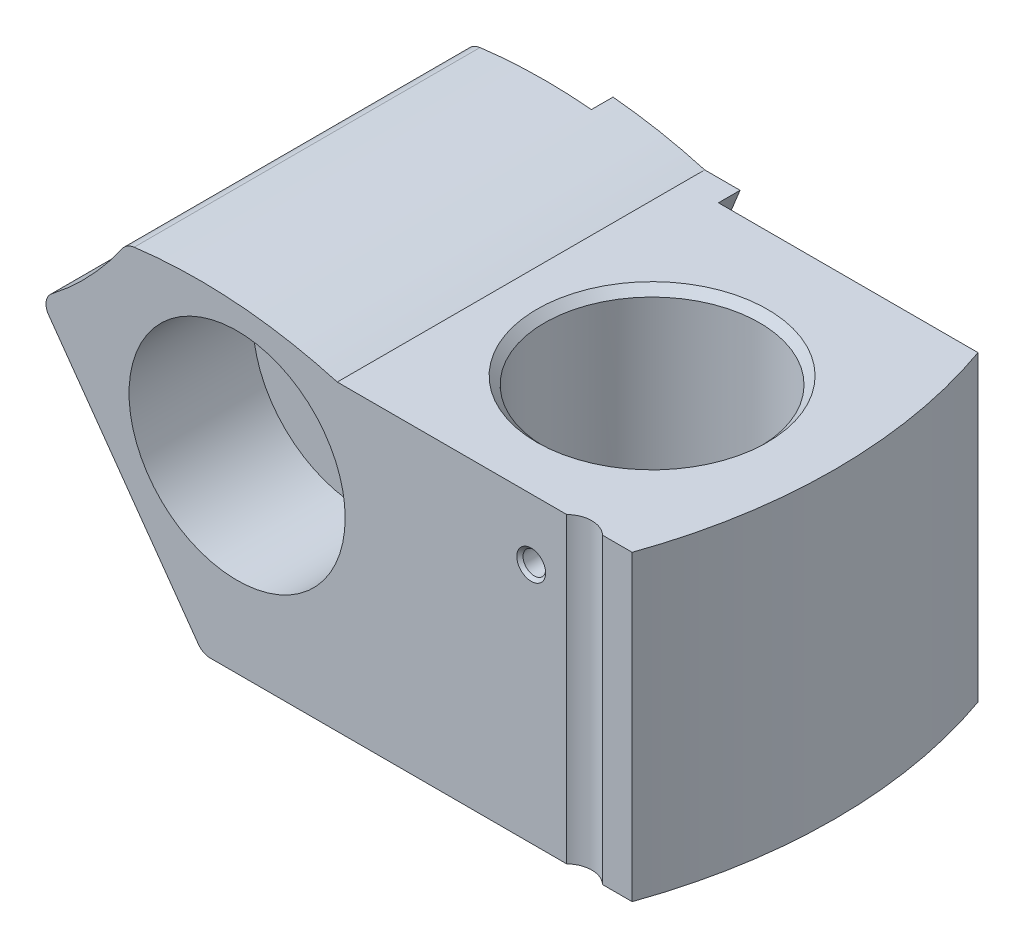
from build123d import *

# Parameters (mm, degrees)
LINEAR_AUSTRAGEN1_DEPTH      = 25.5
LINEAR_AUSTRAGEN2_DEPTH      = 15
LINEAR_AUSTRAGEN2_DEPTH_BACK = 15
SKIZZE2_R                    = 1.8
SKIZZE3_W                    = 50
SKIZZE3_H                    = 25
LINEAR_AUSTRAGEN3_DEPTH      = 1.5
LINEAR_AUSTRAGEN4_DEPTH      = 15
LINEAR_AUSTRAGEN4_DEPTH_BACK = 15


with BuildPart() as part:
    # Skizze1 → Linear austragen1 (new body)
    with BuildSketch(Plane.XY):
        with BuildLine():
            Line((-13.076846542, 1.909538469), (-2.682645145, -12.684134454))
            ThreePointArc((-2.682645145, -12.684134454), (-2.326308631, -12.992857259), (-1.868124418, -13.104))
            Line((-1.868124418, -13.104), (30.6164, -13.104))
            Line((30.6164, -13.104), (30.6164, 7.896))
            Line((30.6164, 7.896), (6.952269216, 7.896))
            ThreePointArc((6.952269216, 7.896), (-0.042169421, 9.14265929), (-7.14425782, 8.951160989))
            ThreePointArc((-7.14425782, 8.951160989), (-7.613740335, 8.786432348), (-7.976052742, 8.445435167))
            ThreePointArc((-7.976052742, 8.445435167), (-10.228913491, 5.676004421), (-12.875283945, 3.279788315))
            ThreePointArc((-12.875283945, 3.279788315), (-13.251679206, 2.635205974), (-13.076846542, 1.909538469))
        make_face()
    extrude(amount=-LINEAR_AUSTRAGEN1_DEPTH)

    # Skizze2 → Linear austragen2 (cut, two sides: drawn at the far end of the back side and taken through both)
    with BuildSketch(Plane(origin=(0, 0, 0), x_dir=(1, 0, 0), z_dir=(0, 1, 0)).offset(-LINEAR_AUSTRAGEN2_DEPTH_BACK)):
        with Locations((24.1178, -1.3)):
            Circle(SKIZZE2_R)
    extrude(amount=LINEAR_AUSTRAGEN2_DEPTH + LINEAR_AUSTRAGEN2_DEPTH_BACK, mode=Mode.SUBTRACT)

    # Skizze3 → Linear austragen3 (cut)
    with BuildSketch(Plane.XY.offset(-24)):
        with Locations((10, -2.5)):
            Rectangle(SKIZZE3_W, SKIZZE3_H)
        with BuildLine():
            Line((-9.497130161, -3.116457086), (-4.507973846, -10.12133535))
            ThreePointArc((-4.507973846, -10.12133535), (3.78443787, -2.143657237), (9.406957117, 7.896))
            Line((9.406957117, 7.896), (6.952269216, 7.896))
            ThreePointArc((6.952269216, 7.896), (3.798211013, 8.64029912), (0.58883127, 9.089683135))
            ThreePointArc((0.58883127, 9.089683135), (-3.65232049, 2.324059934), (-9.497130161, -3.116457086))
        make_face(mode=Mode.SUBTRACT)
    extrude(amount=-LINEAR_AUSTRAGEN3_DEPTH, mode=Mode.SUBTRACT)

    # Skizze4 → Linear austragen4 (cut, two sides: drawn at the far end of the back side and taken through both)
    with BuildSketch(Plane(origin=(0, 0, 0), x_dir=(1, 0, 0), z_dir=(0, 1, 0)).offset(-LINEAR_AUSTRAGEN4_DEPTH_BACK)):
        with BuildLine():
            Line((27.417825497, 0), (45, 0))
            Line((45, 0), (45, 24))
            Line((45, 24), (27.417825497, 24))
            ThreePointArc((27.417825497, 24), (29.4767, 12), (27.417825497, 0))
        make_face()
    extrude(amount=LINEAR_AUSTRAGEN4_DEPTH + LINEAR_AUSTRAGEN4_DEPTH_BACK, mode=Mode.SUBTRACT)

    # Skizze5 → Schnitt-Rotation1 (revolve, cut)
    with BuildSketch(Plane(origin=(0, 0, 0), x_dir=(0, 0, -1), z_dir=(1, 0, 0)), mode=Mode.PRIVATE) as schnitt_rotation1_sk:
        Polygon((0, 0), (0, 7.5), (8.6, 7.5), (8.6, 4.5), (25.5, 4.5), (25.5, 0), align=None)
    revolve(schnitt_rotation1_sk.sketch.rotate(Axis((0, 0, -25.5), (0, 0, 1)), 270), axis=Axis((0, 0, -25.5), (0, 0, 1)), mode=Mode.SUBTRACT)

    # Skizze6 → Schnitt-Rotation2 (revolve, cut)
    with BuildSketch(Plane(origin=(0, 3.646, 0), x_dir=(-1, 0, 0), z_dir=(0, 1, 0)), mode=Mode.PRIVATE) as schnitt_rotation2_sk:
        Polygon((-20.4121, -5), (-21.1956, -5), (-21.1956, -0.2165), (-21.4121, 0), (-20.4121, 0), align=None)
    revolve(schnitt_rotation2_sk.sketch.rotate(Axis((20.4121, 3.646, 0), (0, 0, -1)), 180), axis=Axis((20.4121, 3.646, 0), (0, 0, -1)), mode=Mode.SUBTRACT)

    # Skizze7 → Schnitt-Rotation3 (revolve, cut)
    with BuildSketch(Plane.XY.offset(-11.3), mode=Mode.PRIVATE) as schnitt_rotation3_sk:
        Polygon((17.5, 7.896), (25.5, 7.896), (24.9585, 7.3545), (24.9585, -12.5725), (25.5, -13.114), (17.5, -13.114), align=None)
    revolve(schnitt_rotation3_sk.sketch.rotate(Axis((17.5, -13.114, -11.3), (0, 1, 0)), 270), axis=Axis((17.5, -13.114, -11.3), (0, 1, 0)), mode=Mode.SUBTRACT)


solid = part.part
